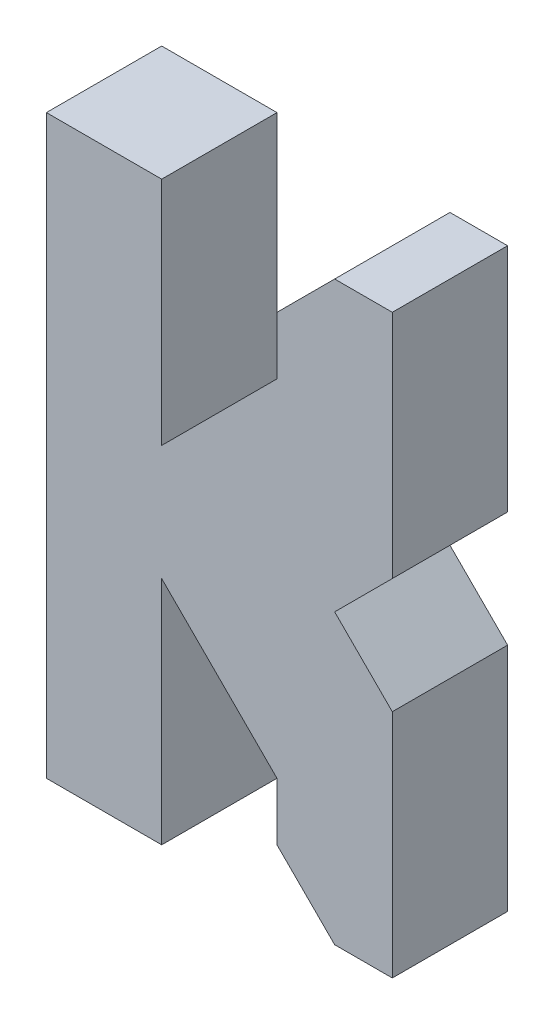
ISO-10303-21;
HEADER;
FILE_DESCRIPTION(('STEP AP214'),'2;1');
FILE_NAME('part.step','',(''),(''),'','','');
FILE_SCHEMA(('AUTOMOTIVE_DESIGN { 1 0 10303 214 1 1 1 1 }'));
ENDSEC;
DATA;
#1=APPLICATION_CONTEXT('core data for automotive mechanical design processes');
#2=APPLICATION_PROTOCOL_DEFINITION('international standard','automotive_design',2000,#1);
#3=PRODUCT_CONTEXT('',#1,'mechanical');
#4=PRODUCT('Part','Part','',(#3));
#5=PRODUCT_RELATED_PRODUCT_CATEGORY('part','',(#4));
#6=PRODUCT_DEFINITION_FORMATION('','',#4);
#7=PRODUCT_DEFINITION_CONTEXT('part definition',#1,'design');
#8=PRODUCT_DEFINITION('design','',#6,#7);
#9=PRODUCT_DEFINITION_SHAPE('','',#8);
#10=(LENGTH_UNIT() NAMED_UNIT(*) SI_UNIT(.MILLI.,.METRE.));
#11=(NAMED_UNIT(*) PLANE_ANGLE_UNIT() SI_UNIT($,.RADIAN.));
#12=(NAMED_UNIT(*) SI_UNIT($,.STERADIAN.) SOLID_ANGLE_UNIT());
#13=UNCERTAINTY_MEASURE_WITH_UNIT(LENGTH_MEASURE(1.E-05),#10,'distance_accuracy_value','');
#14=(GEOMETRIC_REPRESENTATION_CONTEXT(3) GLOBAL_UNCERTAINTY_ASSIGNED_CONTEXT((#13)) GLOBAL_UNIT_ASSIGNED_CONTEXT((#10,
#11,#12)) REPRESENTATION_CONTEXT('',''));
#15=CARTESIAN_POINT('',(0.,0.,0.));
#16=DIRECTION('',(0.,0.,1.));
#17=DIRECTION('',(1.,0.,0.));
#18=AXIS2_PLACEMENT_3D('',#15,#16,#17);
#19=CARTESIAN_POINT('',(0.,0.,10.));
#20=DIRECTION('',(1.,0.,0.));
#21=DIRECTION('',(0.,0.,-1.));
#22=AXIS2_PLACEMENT_3D('',#19,#20,#21);
#23=PLANE('',#22);
#24=DIRECTION('',(0.,-1.,0.));
#25=VECTOR('',#24,1.);
#26=CARTESIAN_POINT('',(0.,0.,0.));
#27=LINE('',#26,#25);
#28=CARTESIAN_POINT('',(0.,50.,0.));
#29=VERTEX_POINT('',#28);
#30=CARTESIAN_POINT('',(0.,0.,0.));
#31=VERTEX_POINT('',#30);
#32=EDGE_CURVE('E175',#29,#31,#27,.T.);
#33=ORIENTED_EDGE('',*,*,#32,.T.);
#34=DIRECTION('',(0.,0.,-1.));
#35=VECTOR('',#34,1.);
#36=CARTESIAN_POINT('',(0.,0.,10.));
#37=LINE('',#36,#35);
#38=CARTESIAN_POINT('',(0.,0.,10.));
#39=VERTEX_POINT('',#38);
#40=EDGE_CURVE('E156',#39,#31,#37,.T.);
#41=ORIENTED_EDGE('',*,*,#40,.F.);
#42=DIRECTION('',(0.,-1.,0.));
#43=VECTOR('',#42,1.);
#44=CARTESIAN_POINT('',(0.,0.,10.));
#45=LINE('',#44,#43);
#46=CARTESIAN_POINT('',(0.,50.,10.));
#47=VERTEX_POINT('',#46);
#48=EDGE_CURVE('E162',#47,#39,#45,.T.);
#49=ORIENTED_EDGE('',*,*,#48,.F.);
#50=DIRECTION('',(0.,0.,-1.));
#51=VECTOR('',#50,1.);
#52=CARTESIAN_POINT('',(0.,50.,10.));
#53=LINE('',#52,#51);
#54=EDGE_CURVE('E241',#47,#29,#53,.T.);
#55=ORIENTED_EDGE('',*,*,#54,.T.);
#56=EDGE_LOOP('',(#33,#41,#49,#55));
#57=FACE_BOUND('',#56,.T.);
#58=ADVANCED_FACE('F33',(#57),#23,.F.);
#59=CARTESIAN_POINT('',(0.,0.,10.));
#60=DIRECTION('',(0.,1.,0.));
#61=DIRECTION('',(0.,0.,1.));
#62=AXIS2_PLACEMENT_3D('',#59,#60,#61);
#63=PLANE('',#62);
#64=DIRECTION('',(1.,0.,0.));
#65=VECTOR('',#64,1.);
#66=CARTESIAN_POINT('',(0.,0.,0.));
#67=LINE('',#66,#65);
#68=CARTESIAN_POINT('',(10.,0.,0.));
#69=VERTEX_POINT('',#68);
#70=EDGE_CURVE('E272',#31,#69,#67,.T.);
#71=ORIENTED_EDGE('',*,*,#70,.T.);
#72=DIRECTION('',(0.,0.,-1.));
#73=VECTOR('',#72,1.);
#74=CARTESIAN_POINT('',(10.,0.,10.));
#75=LINE('',#74,#73);
#76=CARTESIAN_POINT('',(10.,0.,10.));
#77=VERTEX_POINT('',#76);
#78=EDGE_CURVE('E159',#77,#69,#75,.T.);
#79=ORIENTED_EDGE('',*,*,#78,.F.);
#80=DIRECTION('',(1.,0.,0.));
#81=VECTOR('',#80,1.);
#82=CARTESIAN_POINT('',(0.,0.,10.));
#83=LINE('',#82,#81);
#84=EDGE_CURVE('E152',#39,#77,#83,.T.);
#85=ORIENTED_EDGE('',*,*,#84,.F.);
#86=ORIENTED_EDGE('',*,*,#40,.T.);
#87=EDGE_LOOP('',(#71,#79,#85,#86));
#88=FACE_BOUND('',#87,.T.);
#89=ADVANCED_FACE('F154',(#88),#63,.F.);
#90=CARTESIAN_POINT('',(10.,0.,10.));
#91=DIRECTION('',(-1.,0.,0.));
#92=DIRECTION('',(0.,0.,1.));
#93=AXIS2_PLACEMENT_3D('',#90,#91,#92);
#94=PLANE('',#93);
#95=DIRECTION('',(0.,1.,0.));
#96=VECTOR('',#95,1.);
#97=CARTESIAN_POINT('',(10.,0.,0.));
#98=LINE('',#97,#96);
#99=CARTESIAN_POINT('',(10.,20.,0.));
#100=VERTEX_POINT('',#99);
#101=EDGE_CURVE('E270',#69,#100,#98,.T.);
#102=ORIENTED_EDGE('',*,*,#101,.T.);
#103=DIRECTION('',(0.,0.,-1.));
#104=VECTOR('',#103,1.);
#105=CARTESIAN_POINT('',(10.,20.,10.));
#106=LINE('',#105,#104);
#107=CARTESIAN_POINT('',(10.,20.,10.));
#108=VERTEX_POINT('',#107);
#109=EDGE_CURVE('E180',#108,#100,#106,.T.);
#110=ORIENTED_EDGE('',*,*,#109,.F.);
#111=DIRECTION('',(0.,1.,0.));
#112=VECTOR('',#111,1.);
#113=CARTESIAN_POINT('',(10.,0.,10.));
#114=LINE('',#113,#112);
#115=EDGE_CURVE('E161',#77,#108,#114,.T.);
#116=ORIENTED_EDGE('',*,*,#115,.F.);
#117=ORIENTED_EDGE('',*,*,#78,.T.);
#118=EDGE_LOOP('',(#102,#110,#116,#117));
#119=FACE_BOUND('',#118,.T.);
#120=ADVANCED_FACE('F268',(#119),#94,.F.);
#121=CARTESIAN_POINT('',(20.,20.,10.));
#122=DIRECTION('',(1.,0.,0.));
#123=DIRECTION('',(0.,1.,0.));
#124=AXIS2_PLACEMENT_3D('',#121,#122,#123);
#125=PLANE('',#124);
#126=DIRECTION('',(0.,-1.,0.));
#127=VECTOR('',#126,1.);
#128=CARTESIAN_POINT('',(20.,20.,0.));
#129=LINE('',#128,#127);
#130=CARTESIAN_POINT('',(20.,9.99999999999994,0.));
#131=VERTEX_POINT('',#130);
#132=CARTESIAN_POINT('',(20.,5.00000000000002,0.));
#133=VERTEX_POINT('',#132);
#134=EDGE_CURVE('E271',#131,#133,#129,.T.);
#135=ORIENTED_EDGE('',*,*,#134,.T.);
#136=DIRECTION('',(0.,0.,1.));
#137=VECTOR('',#136,1.);
#138=CARTESIAN_POINT('',(20.,5.00000000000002,10.));
#139=LINE('',#138,#137);
#140=CARTESIAN_POINT('',(20.,5.00000000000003,10.));
#141=VERTEX_POINT('',#140);
#142=EDGE_CURVE('E214',#133,#141,#139,.T.);
#143=ORIENTED_EDGE('',*,*,#142,.T.);
#144=DIRECTION('',(0.,-1.,0.));
#145=VECTOR('',#144,1.);
#146=CARTESIAN_POINT('',(20.,20.,10.));
#147=LINE('',#146,#145);
#148=CARTESIAN_POINT('',(20.,9.99999999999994,10.));
#149=VERTEX_POINT('',#148);
#150=EDGE_CURVE('E352',#149,#141,#147,.T.);
#151=ORIENTED_EDGE('',*,*,#150,.F.);
#152=DIRECTION('',(0.,0.,-1.));
#153=VECTOR('',#152,1.);
#154=CARTESIAN_POINT('',(20.,9.99999999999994,0.));
#155=LINE('',#154,#153);
#156=EDGE_CURVE('E189',#149,#131,#155,.T.);
#157=ORIENTED_EDGE('',*,*,#156,.T.);
#158=EDGE_LOOP('',(#135,#143,#151,#157));
#159=FACE_BOUND('',#158,.T.);
#160=ADVANCED_FACE('F360',(#159),#125,.F.);
#161=CARTESIAN_POINT('',(30.,0.,10.));
#162=DIRECTION('',(0.,1.,0.));
#163=DIRECTION('',(-1.,0.,0.));
#164=AXIS2_PLACEMENT_3D('',#161,#162,#163);
#165=PLANE('',#164);
#166=DIRECTION('',(1.,0.,0.));
#167=VECTOR('',#166,1.);
#168=CARTESIAN_POINT('',(30.,0.,10.));
#169=LINE('',#168,#167);
#170=CARTESIAN_POINT('',(25.,0.,10.));
#171=VERTEX_POINT('',#170);
#172=CARTESIAN_POINT('',(30.,0.,10.));
#173=VERTEX_POINT('',#172);
#174=EDGE_CURVE('E349',#171,#173,#169,.T.);
#175=ORIENTED_EDGE('',*,*,#174,.F.);
#176=DIRECTION('',(0.,0.,-1.));
#177=VECTOR('',#176,1.);
#178=CARTESIAN_POINT('',(25.,0.,10.));
#179=LINE('',#178,#177);
#180=CARTESIAN_POINT('',(25.,0.,0.));
#181=VERTEX_POINT('',#180);
#182=EDGE_CURVE('E207',#171,#181,#179,.T.);
#183=ORIENTED_EDGE('',*,*,#182,.T.);
#184=DIRECTION('',(1.,0.,0.));
#185=VECTOR('',#184,1.);
#186=CARTESIAN_POINT('',(30.,0.,0.));
#187=LINE('',#186,#185);
#188=CARTESIAN_POINT('',(30.,0.,0.));
#189=VERTEX_POINT('',#188);
#190=EDGE_CURVE('E275',#181,#189,#187,.T.);
#191=ORIENTED_EDGE('',*,*,#190,.T.);
#192=DIRECTION('',(0.,0.,-1.));
#193=VECTOR('',#192,1.);
#194=CARTESIAN_POINT('',(30.,0.,10.));
#195=LINE('',#194,#193);
#196=EDGE_CURVE('E258',#173,#189,#195,.T.);
#197=ORIENTED_EDGE('',*,*,#196,.F.);
#198=EDGE_LOOP('',(#175,#183,#191,#197));
#199=FACE_BOUND('',#198,.T.);
#200=ADVANCED_FACE('F354',(#199),#165,.F.);
#201=CARTESIAN_POINT('',(30.,20.,10.));
#202=DIRECTION('',(-1.,0.,0.));
#203=DIRECTION('',(0.,0.,1.));
#204=AXIS2_PLACEMENT_3D('',#201,#202,#203);
#205=PLANE('',#204);
#206=DIRECTION('',(0.,1.,0.));
#207=VECTOR('',#206,1.);
#208=CARTESIAN_POINT('',(30.,20.,0.));
#209=LINE('',#208,#207);
#210=CARTESIAN_POINT('',(30.,20.,0.));
#211=VERTEX_POINT('',#210);
#212=EDGE_CURVE('E281',#189,#211,#209,.T.);
#213=ORIENTED_EDGE('',*,*,#212,.T.);
#214=DIRECTION('',(0.,0.,-1.));
#215=VECTOR('',#214,1.);
#216=CARTESIAN_POINT('',(30.,20.,10.));
#217=LINE('',#216,#215);
#218=CARTESIAN_POINT('',(30.,20.,10.));
#219=VERTEX_POINT('',#218);
#220=EDGE_CURVE('E255',#219,#211,#217,.T.);
#221=ORIENTED_EDGE('',*,*,#220,.F.);
#222=DIRECTION('',(0.,1.,0.));
#223=VECTOR('',#222,1.);
#224=CARTESIAN_POINT('',(30.,20.,10.));
#225=LINE('',#224,#223);
#226=EDGE_CURVE('E295',#173,#219,#225,.T.);
#227=ORIENTED_EDGE('',*,*,#226,.F.);
#228=ORIENTED_EDGE('',*,*,#196,.T.);
#229=EDGE_LOOP('',(#213,#221,#227,#228));
#230=FACE_BOUND('',#229,.T.);
#231=ADVANCED_FACE('F364',(#230),#205,.F.);
#232=CARTESIAN_POINT('',(30.,30.,10.));
#233=DIRECTION('',(-1.,0.,0.));
#234=DIRECTION('',(0.,-1.,0.));
#235=AXIS2_PLACEMENT_3D('',#232,#233,#234);
#236=PLANE('',#235);
#237=DIRECTION('',(0.,1.,0.));
#238=VECTOR('',#237,1.);
#239=CARTESIAN_POINT('',(30.,30.,0.));
#240=LINE('',#239,#238);
#241=CARTESIAN_POINT('',(30.,30.,0.));
#242=VERTEX_POINT('',#241);
#243=CARTESIAN_POINT('',(30.,50.,0.));
#244=VERTEX_POINT('',#243);
#245=EDGE_CURVE('E236',#242,#244,#240,.T.);
#246=ORIENTED_EDGE('',*,*,#245,.T.);
#247=DIRECTION('',(0.,0.,-1.));
#248=VECTOR('',#247,1.);
#249=CARTESIAN_POINT('',(30.,50.,10.));
#250=LINE('',#249,#248);
#251=CARTESIAN_POINT('',(30.,50.,10.));
#252=VERTEX_POINT('',#251);
#253=EDGE_CURVE('E249',#252,#244,#250,.T.);
#254=ORIENTED_EDGE('',*,*,#253,.F.);
#255=DIRECTION('',(0.,1.,0.));
#256=VECTOR('',#255,1.);
#257=CARTESIAN_POINT('',(30.,30.,10.));
#258=LINE('',#257,#256);
#259=CARTESIAN_POINT('',(30.,30.,10.));
#260=VERTEX_POINT('',#259);
#261=EDGE_CURVE('E291',#260,#252,#258,.T.);
#262=ORIENTED_EDGE('',*,*,#261,.F.);
#263=DIRECTION('',(0.,0.,-1.));
#264=VECTOR('',#263,1.);
#265=CARTESIAN_POINT('',(30.,30.,10.));
#266=LINE('',#265,#264);
#267=EDGE_CURVE('E252',#260,#242,#266,.T.);
#268=ORIENTED_EDGE('',*,*,#267,.T.);
#269=EDGE_LOOP('',(#246,#254,#262,#268));
#270=FACE_BOUND('',#269,.T.);
#271=ADVANCED_FACE('F286',(#270),#236,.F.);
#272=CARTESIAN_POINT('',(30.,50.,10.));
#273=DIRECTION('',(0.,-1.,0.));
#274=DIRECTION('',(0.,0.,-1.));
#275=AXIS2_PLACEMENT_3D('',#272,#273,#274);
#276=PLANE('',#275);
#277=DIRECTION('',(-1.,0.,0.));
#278=VECTOR('',#277,1.);
#279=CARTESIAN_POINT('',(30.,50.,0.));
#280=LINE('',#279,#278);
#281=CARTESIAN_POINT('',(25.,50.,0.));
#282=VERTEX_POINT('',#281);
#283=EDGE_CURVE('E233',#244,#282,#280,.T.);
#284=ORIENTED_EDGE('',*,*,#283,.T.);
#285=DIRECTION('',(0.,0.,1.));
#286=VECTOR('',#285,1.);
#287=CARTESIAN_POINT('',(25.,50.,10.));
#288=LINE('',#287,#286);
#289=CARTESIAN_POINT('',(25.,50.,10.));
#290=VERTEX_POINT('',#289);
#291=EDGE_CURVE('E11',#282,#290,#288,.T.);
#292=ORIENTED_EDGE('',*,*,#291,.T.);
#293=DIRECTION('',(-1.,0.,0.));
#294=VECTOR('',#293,1.);
#295=CARTESIAN_POINT('',(30.,50.,10.));
#296=LINE('',#295,#294);
#297=EDGE_CURVE('E290',#252,#290,#296,.T.);
#298=ORIENTED_EDGE('',*,*,#297,.F.);
#299=ORIENTED_EDGE('',*,*,#253,.T.);
#300=EDGE_LOOP('',(#284,#292,#298,#299));
#301=FACE_BOUND('',#300,.T.);
#302=ADVANCED_FACE('F289',(#301),#276,.F.);
#303=CARTESIAN_POINT('',(20.,30.,10.));
#304=DIRECTION('',(1.,0.,0.));
#305=DIRECTION('',(0.,0.,-1.));
#306=AXIS2_PLACEMENT_3D('',#303,#304,#305);
#307=PLANE('',#306);
#308=DIRECTION('',(0.,-1.,0.));
#309=VECTOR('',#308,1.);
#310=CARTESIAN_POINT('',(20.,30.,10.));
#311=LINE('',#310,#309);
#312=CARTESIAN_POINT('',(20.,45.,10.));
#313=VERTEX_POINT('',#312);
#314=CARTESIAN_POINT('',(20.,40.,10.));
#315=VERTEX_POINT('',#314);
#316=EDGE_CURVE('E224',#313,#315,#311,.T.);
#317=ORIENTED_EDGE('',*,*,#316,.F.);
#318=DIRECTION('',(0.,0.,-1.));
#319=VECTOR('',#318,1.);
#320=CARTESIAN_POINT('',(20.,45.,10.));
#321=LINE('',#320,#319);
#322=CARTESIAN_POINT('',(20.,45.,0.));
#323=VERTEX_POINT('',#322);
#324=EDGE_CURVE('E41',#313,#323,#321,.T.);
#325=ORIENTED_EDGE('',*,*,#324,.T.);
#326=DIRECTION('',(0.,-1.,0.));
#327=VECTOR('',#326,1.);
#328=CARTESIAN_POINT('',(20.,30.,0.));
#329=LINE('',#328,#327);
#330=CARTESIAN_POINT('',(20.,40.,0.));
#331=VERTEX_POINT('',#330);
#332=EDGE_CURVE('E223',#323,#331,#329,.T.);
#333=ORIENTED_EDGE('',*,*,#332,.T.);
#334=DIRECTION('',(0.,0.,1.));
#335=VECTOR('',#334,1.);
#336=CARTESIAN_POINT('',(20.,40.,10.));
#337=LINE('',#336,#335);
#338=EDGE_CURVE('E195',#331,#315,#337,.T.);
#339=ORIENTED_EDGE('',*,*,#338,.T.);
#340=EDGE_LOOP('',(#317,#325,#333,#339));
#341=FACE_BOUND('',#340,.T.);
#342=ADVANCED_FACE('F222',(#341),#307,.F.);
#343=CARTESIAN_POINT('',(10.,30.,10.));
#344=DIRECTION('',(-1.,0.,0.));
#345=DIRECTION('',(0.,0.,1.));
#346=AXIS2_PLACEMENT_3D('',#343,#344,#345);
#347=PLANE('',#346);
#348=DIRECTION('',(0.,1.,0.));
#349=VECTOR('',#348,1.);
#350=CARTESIAN_POINT('',(10.,30.,0.));
#351=LINE('',#350,#349);
#352=CARTESIAN_POINT('',(10.,30.,0.));
#353=VERTEX_POINT('',#352);
#354=CARTESIAN_POINT('',(10.,50.,0.));
#355=VERTEX_POINT('',#354);
#356=EDGE_CURVE('E232',#353,#355,#351,.T.);
#357=ORIENTED_EDGE('',*,*,#356,.T.);
#358=DIRECTION('',(0.,0.,-1.));
#359=VECTOR('',#358,1.);
#360=CARTESIAN_POINT('',(10.,50.,10.));
#361=LINE('',#360,#359);
#362=CARTESIAN_POINT('',(10.,50.,10.));
#363=VERTEX_POINT('',#362);
#364=EDGE_CURVE('E243',#363,#355,#361,.T.);
#365=ORIENTED_EDGE('',*,*,#364,.F.);
#366=DIRECTION('',(0.,1.,0.));
#367=VECTOR('',#366,1.);
#368=CARTESIAN_POINT('',(10.,30.,10.));
#369=LINE('',#368,#367);
#370=CARTESIAN_POINT('',(10.,30.,10.));
#371=VERTEX_POINT('',#370);
#372=EDGE_CURVE('E293',#371,#363,#369,.T.);
#373=ORIENTED_EDGE('',*,*,#372,.F.);
#374=DIRECTION('',(0.,0.,-1.));
#375=VECTOR('',#374,1.);
#376=CARTESIAN_POINT('',(10.,30.,10.));
#377=LINE('',#376,#375);
#378=EDGE_CURVE('E246',#371,#353,#377,.T.);
#379=ORIENTED_EDGE('',*,*,#378,.T.);
#380=EDGE_LOOP('',(#357,#365,#373,#379));
#381=FACE_BOUND('',#380,.T.);
#382=ADVANCED_FACE('F305',(#381),#347,.F.);
#383=CARTESIAN_POINT('',(0.,50.,10.));
#384=DIRECTION('',(0.,-1.,0.));
#385=DIRECTION('',(0.,0.,-1.));
#386=AXIS2_PLACEMENT_3D('',#383,#384,#385);
#387=PLANE('',#386);
#388=DIRECTION('',(-1.,0.,0.));
#389=VECTOR('',#388,1.);
#390=CARTESIAN_POINT('',(0.,50.,0.));
#391=LINE('',#390,#389);
#392=EDGE_CURVE('E172',#355,#29,#391,.T.);
#393=ORIENTED_EDGE('',*,*,#392,.T.);
#394=ORIENTED_EDGE('',*,*,#54,.F.);
#395=DIRECTION('',(-1.,0.,0.));
#396=VECTOR('',#395,1.);
#397=CARTESIAN_POINT('',(0.,50.,10.));
#398=LINE('',#397,#396);
#399=EDGE_CURVE('E168',#363,#47,#398,.T.);
#400=ORIENTED_EDGE('',*,*,#399,.F.);
#401=ORIENTED_EDGE('',*,*,#364,.T.);
#402=EDGE_LOOP('',(#393,#394,#400,#401));
#403=FACE_BOUND('',#402,.T.);
#404=ADVANCED_FACE('F308',(#403),#387,.F.);
#405=CARTESIAN_POINT('',(0.,0.,10.));
#406=DIRECTION('',(0.,0.,-1.));
#407=DIRECTION('',(-1.,0.,0.));
#408=AXIS2_PLACEMENT_3D('',#405,#406,#407);
#409=PLANE('',#408);
#410=ORIENTED_EDGE('',*,*,#150,.T.);
#411=DIRECTION('',(-0.707106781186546,0.707106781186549,0.));
#412=VECTOR('',#411,1.);
#413=CARTESIAN_POINT('',(25.,0.,10.));
#414=LINE('',#413,#412);
#415=EDGE_CURVE('E217',#141,#171,#414,.F.);
#416=ORIENTED_EDGE('',*,*,#415,.T.);
#417=ORIENTED_EDGE('',*,*,#174,.T.);
#418=ORIENTED_EDGE('',*,*,#226,.T.);
#419=DIRECTION('',(0.707106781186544,-0.707106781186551,0.));
#420=VECTOR('',#419,1.);
#421=CARTESIAN_POINT('',(25.0000000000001,24.9999999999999,10.));
#422=LINE('',#421,#420);
#423=CARTESIAN_POINT('',(25.,25.,10.));
#424=VERTEX_POINT('',#423);
#425=EDGE_CURVE('E187',#219,#424,#422,.F.);
#426=ORIENTED_EDGE('',*,*,#425,.T.);
#427=DIRECTION('',(-0.707106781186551,-0.707106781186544,0.));
#428=VECTOR('',#427,1.);
#429=CARTESIAN_POINT('',(-1.25116742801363E-13,1.25116742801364E-13,10.));
#430=LINE('',#429,#428);
#431=EDGE_CURVE('E178',#424,#260,#430,.F.);
#432=ORIENTED_EDGE('',*,*,#431,.T.);
#433=ORIENTED_EDGE('',*,*,#261,.T.);
#434=ORIENTED_EDGE('',*,*,#297,.T.);
#435=DIRECTION('',(0.707106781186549,0.707106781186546,0.));
#436=VECTOR('',#435,1.);
#437=CARTESIAN_POINT('',(20.,45.,10.));
#438=LINE('',#437,#436);
#439=EDGE_CURVE('E48',#290,#313,#438,.F.);
#440=ORIENTED_EDGE('',*,*,#439,.T.);
#441=ORIENTED_EDGE('',*,*,#316,.T.);
#442=DIRECTION('',(0.707106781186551,0.707106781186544,0.));
#443=VECTOR('',#442,1.);
#444=CARTESIAN_POINT('',(-10.0000000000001,10.0000000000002,10.));
#445=LINE('',#444,#443);
#446=EDGE_CURVE('E205',#315,#371,#445,.F.);
#447=ORIENTED_EDGE('',*,*,#446,.T.);
#448=ORIENTED_EDGE('',*,*,#372,.T.);
#449=ORIENTED_EDGE('',*,*,#399,.T.);
#450=ORIENTED_EDGE('',*,*,#48,.T.);
#451=ORIENTED_EDGE('',*,*,#84,.T.);
#452=ORIENTED_EDGE('',*,*,#115,.T.);
#453=DIRECTION('',(-0.707106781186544,0.707106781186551,0.));
#454=VECTOR('',#453,1.);
#455=CARTESIAN_POINT('',(15.0000000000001,14.9999999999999,10.));
#456=LINE('',#455,#454);
#457=EDGE_CURVE('E200',#108,#149,#456,.F.);
#458=ORIENTED_EDGE('',*,*,#457,.T.);
#459=EDGE_LOOP('',(#410,#416,#417,#418,#426,#432,#433,#434,#440,#441,#447,#448,#449,#450,#451,
#452,#458));
#460=FACE_BOUND('',#459,.T.);
#461=ADVANCED_FACE('F166',(#460),#409,.F.);
#462=CARTESIAN_POINT('',(0.,0.,0.));
#463=DIRECTION('',(0.,0.,-1.));
#464=DIRECTION('',(-1.,0.,0.));
#465=AXIS2_PLACEMENT_3D('',#462,#463,#464);
#466=PLANE('',#465);
#467=ORIENTED_EDGE('',*,*,#190,.F.);
#468=DIRECTION('',(0.707106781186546,-0.707106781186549,0.));
#469=VECTOR('',#468,1.);
#470=CARTESIAN_POINT('',(12.5000000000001,12.5,0.));
#471=LINE('',#470,#469);
#472=EDGE_CURVE('E212',#181,#133,#471,.F.);
#473=ORIENTED_EDGE('',*,*,#472,.T.);
#474=ORIENTED_EDGE('',*,*,#134,.F.);
#475=DIRECTION('',(0.707106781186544,-0.707106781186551,0.));
#476=VECTOR('',#475,1.);
#477=CARTESIAN_POINT('',(20.,9.99999999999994,0.));
#478=LINE('',#477,#476);
#479=EDGE_CURVE('E198',#131,#100,#478,.F.);
#480=ORIENTED_EDGE('',*,*,#479,.T.);
#481=ORIENTED_EDGE('',*,*,#101,.F.);
#482=ORIENTED_EDGE('',*,*,#70,.F.);
#483=ORIENTED_EDGE('',*,*,#32,.F.);
#484=ORIENTED_EDGE('',*,*,#392,.F.);
#485=ORIENTED_EDGE('',*,*,#356,.F.);
#486=DIRECTION('',(-0.707106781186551,-0.707106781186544,0.));
#487=VECTOR('',#486,1.);
#488=CARTESIAN_POINT('',(9.99999999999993,30.,0.));
#489=LINE('',#488,#487);
#490=EDGE_CURVE('E202',#353,#331,#489,.F.);
#491=ORIENTED_EDGE('',*,*,#490,.T.);
#492=ORIENTED_EDGE('',*,*,#332,.F.);
#493=DIRECTION('',(-0.707106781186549,-0.707106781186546,0.));
#494=VECTOR('',#493,1.);
#495=CARTESIAN_POINT('',(-12.5,12.5000000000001,0.));
#496=LINE('',#495,#494);
#497=EDGE_CURVE('E210',#323,#282,#496,.F.);
#498=ORIENTED_EDGE('',*,*,#497,.T.);
#499=ORIENTED_EDGE('',*,*,#283,.F.);
#500=ORIENTED_EDGE('',*,*,#245,.F.);
#501=DIRECTION('',(0.707106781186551,0.707106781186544,0.));
#502=VECTOR('',#501,1.);
#503=CARTESIAN_POINT('',(30.,30.,0.));
#504=LINE('',#503,#502);
#505=CARTESIAN_POINT('',(25.,25.,0.));
#506=VERTEX_POINT('',#505);
#507=EDGE_CURVE('E176',#242,#506,#504,.F.);
#508=ORIENTED_EDGE('',*,*,#507,.T.);
#509=DIRECTION('',(-0.707106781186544,0.707106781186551,0.));
#510=VECTOR('',#509,1.);
#511=CARTESIAN_POINT('',(25.,25.,0.));
#512=LINE('',#511,#510);
#513=EDGE_CURVE('E185',#506,#211,#512,.F.);
#514=ORIENTED_EDGE('',*,*,#513,.T.);
#515=ORIENTED_EDGE('',*,*,#212,.F.);
#516=EDGE_LOOP('',(#467,#473,#474,#480,#481,#482,#483,#484,#485,#491,#492,#498,#499,#500,#508,
#514,#515));
#517=FACE_BOUND('',#516,.T.);
#518=ADVANCED_FACE('F228',(#517),#466,.T.);
#519=CARTESIAN_POINT('',(25.,25.,10.));
#520=DIRECTION('',(0.707106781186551,0.707106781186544,0.));
#521=DIRECTION('',(0.,0.,1.));
#522=AXIS2_PLACEMENT_3D('',#519,#520,#521);
#523=PLANE('',#522);
#524=DIRECTION('',(0.,0.,-1.));
#525=VECTOR('',#524,1.);
#526=CARTESIAN_POINT('',(25.,25.,0.));
#527=LINE('',#526,#525);
#528=EDGE_CURVE('E190',#424,#506,#527,.T.);
#529=ORIENTED_EDGE('',*,*,#528,.F.);
#530=ORIENTED_EDGE('',*,*,#425,.F.);
#531=ORIENTED_EDGE('',*,*,#220,.T.);
#532=ORIENTED_EDGE('',*,*,#513,.F.);
#533=EDGE_LOOP('',(#529,#530,#531,#532));
#534=FACE_BOUND('',#533,.T.);
#535=ADVANCED_FACE('F329',(#534),#523,.T.);
#536=CARTESIAN_POINT('',(30.,30.,10.));
#537=DIRECTION('',(0.707106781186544,-0.707106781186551,0.));
#538=DIRECTION('',(0.,0.,1.));
#539=AXIS2_PLACEMENT_3D('',#536,#537,#538);
#540=PLANE('',#539);
#541=ORIENTED_EDGE('',*,*,#431,.F.);
#542=ORIENTED_EDGE('',*,*,#528,.T.);
#543=ORIENTED_EDGE('',*,*,#507,.F.);
#544=ORIENTED_EDGE('',*,*,#267,.F.);
#545=EDGE_LOOP('',(#541,#542,#543,#544));
#546=FACE_BOUND('',#545,.T.);
#547=ADVANCED_FACE('F326',(#546),#540,.T.);
#548=CARTESIAN_POINT('',(20.,9.99999999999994,10.));
#549=DIRECTION('',(-0.707106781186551,-0.707106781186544,0.));
#550=DIRECTION('',(0.,0.,1.));
#551=AXIS2_PLACEMENT_3D('',#548,#549,#550);
#552=PLANE('',#551);
#553=ORIENTED_EDGE('',*,*,#457,.F.);
#554=ORIENTED_EDGE('',*,*,#109,.T.);
#555=ORIENTED_EDGE('',*,*,#479,.F.);
#556=ORIENTED_EDGE('',*,*,#156,.F.);
#557=EDGE_LOOP('',(#553,#554,#555,#556));
#558=FACE_BOUND('',#557,.T.);
#559=ADVANCED_FACE('F264',(#558),#552,.T.);
#560=CARTESIAN_POINT('',(9.99999999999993,30.,10.));
#561=DIRECTION('',(-0.707106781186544,0.707106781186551,0.));
#562=DIRECTION('',(0.,0.,1.));
#563=AXIS2_PLACEMENT_3D('',#560,#561,#562);
#564=PLANE('',#563);
#565=ORIENTED_EDGE('',*,*,#446,.F.);
#566=ORIENTED_EDGE('',*,*,#338,.F.);
#567=ORIENTED_EDGE('',*,*,#490,.F.);
#568=ORIENTED_EDGE('',*,*,#378,.F.);
#569=EDGE_LOOP('',(#565,#566,#567,#568));
#570=FACE_BOUND('',#569,.T.);
#571=ADVANCED_FACE('F336',(#570),#564,.T.);
#572=CARTESIAN_POINT('',(25.,0.,10.));
#573=DIRECTION('',(0.707106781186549,0.707106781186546,0.));
#574=DIRECTION('',(0.,0.,-1.));
#575=AXIS2_PLACEMENT_3D('',#572,#573,#574);
#576=PLANE('',#575);
#577=ORIENTED_EDGE('',*,*,#415,.F.);
#578=ORIENTED_EDGE('',*,*,#142,.F.);
#579=ORIENTED_EDGE('',*,*,#472,.F.);
#580=ORIENTED_EDGE('',*,*,#182,.F.);
#581=EDGE_LOOP('',(#577,#578,#579,#580));
#582=FACE_BOUND('',#581,.T.);
#583=ADVANCED_FACE('F338',(#582),#576,.F.);
#584=CARTESIAN_POINT('',(20.,45.,10.));
#585=DIRECTION('',(0.707106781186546,-0.707106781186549,0.));
#586=DIRECTION('',(0.,0.,-1.));
#587=AXIS2_PLACEMENT_3D('',#584,#585,#586);
#588=PLANE('',#587);
#589=ORIENTED_EDGE('',*,*,#439,.F.);
#590=ORIENTED_EDGE('',*,*,#291,.F.);
#591=ORIENTED_EDGE('',*,*,#497,.F.);
#592=ORIENTED_EDGE('',*,*,#324,.F.);
#593=EDGE_LOOP('',(#589,#590,#591,#592));
#594=FACE_BOUND('',#593,.T.);
#595=ADVANCED_FACE('F35',(#594),#588,.F.);
#596=CLOSED_SHELL('',(#58,#89,#120,#160,#200,#231,#271,#302,#342,#382,#404,#461,#518,#535,#547,
#559,#571,#583,#595));
#597=MANIFOLD_SOLID_BREP('B2',#596);
#598=ADVANCED_BREP_SHAPE_REPRESENTATION('',(#18,#597),#14);
#599=SHAPE_DEFINITION_REPRESENTATION(#9,#598);
ENDSEC;
END-ISO-10303-21;
